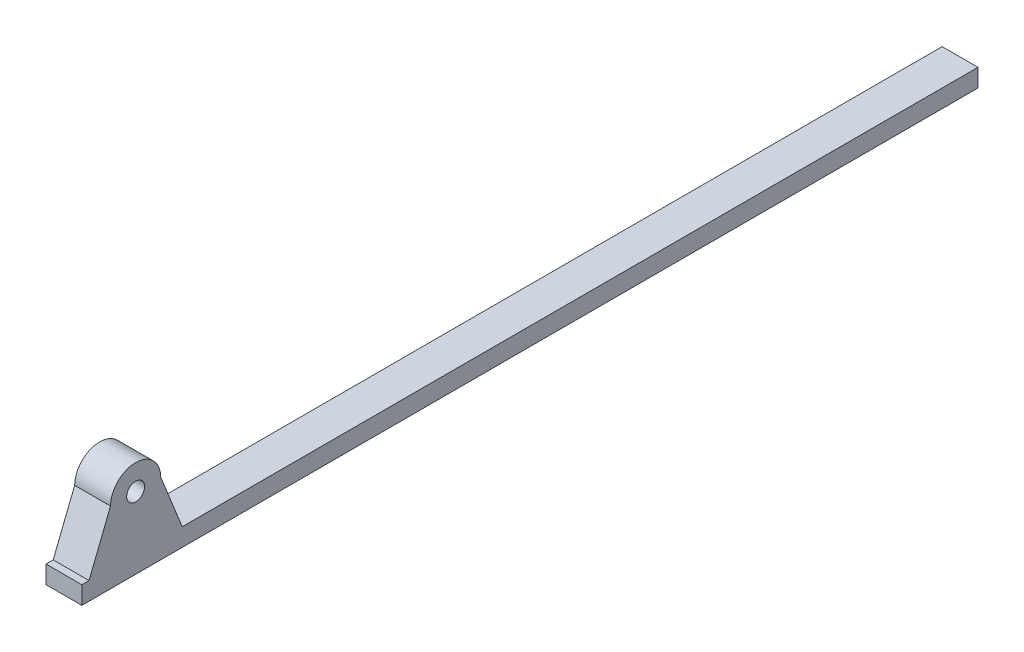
from build123d import *

# Parameters (mm, degrees)
CROQUIS1_R              = 2.5
SALIENTE_EXTRUIR1_DEPTH = 5


with BuildPart() as part:
    # Croquis1 → Saliente-Extruir1 (new, symmetric)
    with BuildSketch(Plane(origin=(0, 0, 0), x_dir=(0, 0, -1), z_dir=(1, 0, 0))):
        with BuildLine():
            Line((125, -2.5), (-125, -2.5))
            Line((-125, -2.5), (-125, 2.5))
            Line((-125, 2.5), (-123, 2.5))
            Line((-123, 2.5), (-117, 17.5))
            ThreePointArc((-117, 17.5), (-110, 24.5), (-103, 17.5))
            Line((-103, 17.5), (-97, 2.5))
            Line((-97, 2.5), (125, 2.5))
            Line((125, 2.5), (125, -2.5))
        make_face()
        with Locations((-110, 17.5)):
            Circle(CROQUIS1_R, mode=Mode.SUBTRACT)
    extrude(amount=SALIENTE_EXTRUIR1_DEPTH, both=True)


solid = part.part
